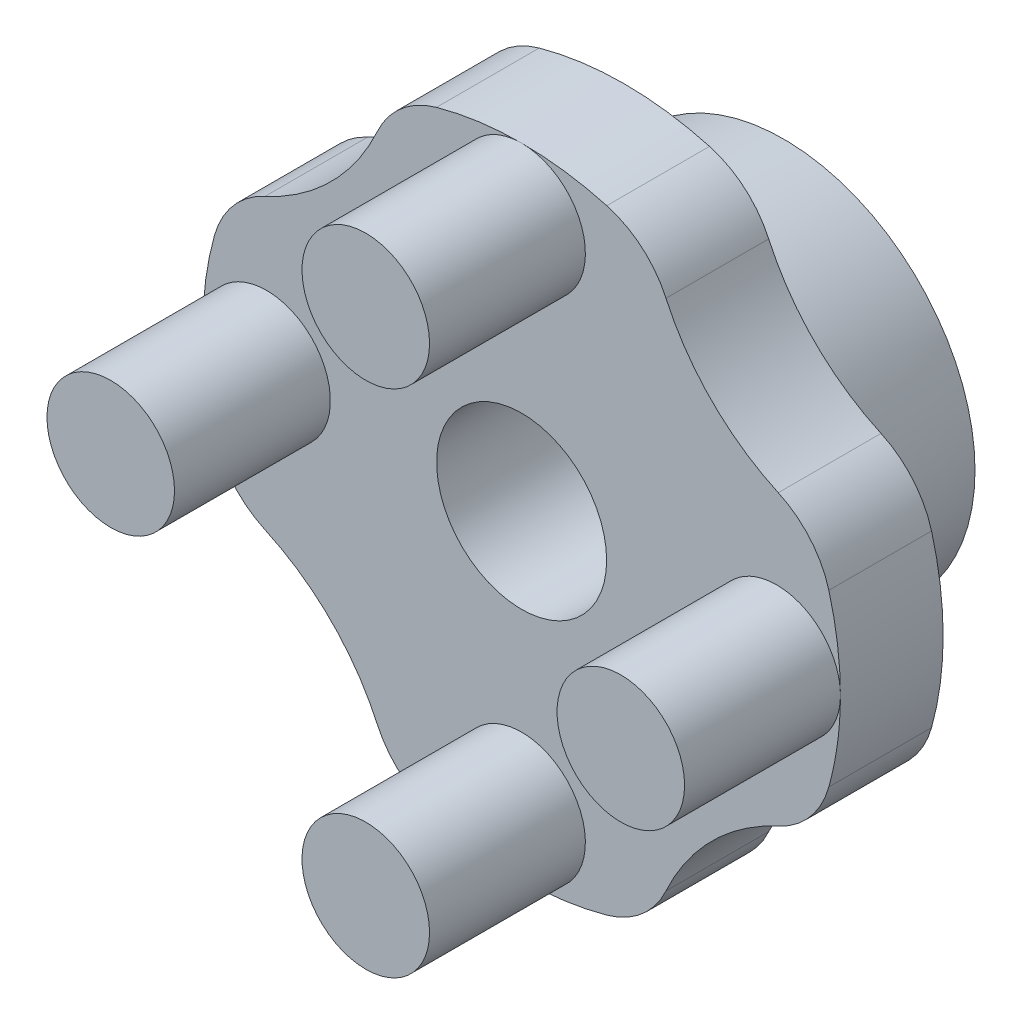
ISO-10303-21;
HEADER;
FILE_DESCRIPTION(('STEP AP214'),'2;1');
FILE_NAME('part.step','',(''),(''),'','','');
FILE_SCHEMA(('AUTOMOTIVE_DESIGN { 1 0 10303 214 1 1 1 1 }'));
ENDSEC;
DATA;
#1=APPLICATION_CONTEXT('core data for automotive mechanical design processes');
#2=APPLICATION_PROTOCOL_DEFINITION('international standard','automotive_design',2000,#1);
#3=PRODUCT_CONTEXT('',#1,'mechanical');
#4=PRODUCT('Part','Part','',(#3));
#5=PRODUCT_RELATED_PRODUCT_CATEGORY('part','',(#4));
#6=PRODUCT_DEFINITION_FORMATION('','',#4);
#7=PRODUCT_DEFINITION_CONTEXT('part definition',#1,'design');
#8=PRODUCT_DEFINITION('design','',#6,#7);
#9=PRODUCT_DEFINITION_SHAPE('','',#8);
#10=(LENGTH_UNIT() NAMED_UNIT(*) SI_UNIT(.MILLI.,.METRE.));
#11=(NAMED_UNIT(*) PLANE_ANGLE_UNIT() SI_UNIT($,.RADIAN.));
#12=(NAMED_UNIT(*) SI_UNIT($,.STERADIAN.) SOLID_ANGLE_UNIT());
#13=UNCERTAINTY_MEASURE_WITH_UNIT(LENGTH_MEASURE(1.E-05),#10,'distance_accuracy_value','');
#14=(GEOMETRIC_REPRESENTATION_CONTEXT(3) GLOBAL_UNCERTAINTY_ASSIGNED_CONTEXT((#13)) GLOBAL_UNIT_ASSIGNED_CONTEXT((#10,
#11,#12)) REPRESENTATION_CONTEXT('',''));
#15=CARTESIAN_POINT('',(0.,0.,0.));
#16=DIRECTION('',(0.,0.,1.));
#17=DIRECTION('',(1.,0.,0.));
#18=AXIS2_PLACEMENT_3D('',#15,#16,#17);
#19=CARTESIAN_POINT('',(0.,0.,90.));
#20=DIRECTION('',(0.,0.,1.));
#21=DIRECTION('',(1.,0.,0.));
#22=AXIS2_PLACEMENT_3D('',#19,#20,#21);
#23=CYLINDRICAL_SURFACE('',#22,45.);
#24=CARTESIAN_POINT('',(0.,0.,22.5));
#25=DIRECTION('',(0.,0.,1.));
#26=DIRECTION('',(1.,0.,0.));
#27=AXIS2_PLACEMENT_3D('',#24,#25,#26);
#28=CIRCLE('',#27,45.);
#29=CARTESIAN_POINT('',(-43.3644250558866,12.021923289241,22.5));
#30=VERTEX_POINT('',#29);
#31=CARTESIAN_POINT('',(-43.3644250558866,-12.0219232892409,22.5));
#32=VERTEX_POINT('',#31);
#33=EDGE_CURVE('E171',#30,#32,#28,.T.);
#34=ORIENTED_EDGE('',*,*,#33,.T.);
#35=DIRECTION('',(0.,0.,1.));
#36=VECTOR('',#35,1.);
#37=CARTESIAN_POINT('',(-43.3644250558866,-12.0219232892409,90.));
#38=LINE('',#37,#36);
#39=CARTESIAN_POINT('',(-43.3644250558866,-12.0219232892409,37.));
#40=VERTEX_POINT('',#39);
#41=EDGE_CURVE('E225',#32,#40,#38,.T.);
#42=ORIENTED_EDGE('',*,*,#41,.T.);
#43=CARTESIAN_POINT('',(0.,0.,37.));
#44=DIRECTION('',(0.,0.,1.));
#45=DIRECTION('',(1.,0.,0.));
#46=AXIS2_PLACEMENT_3D('',#43,#44,#45);
#47=CIRCLE('',#46,45.);
#48=CARTESIAN_POINT('',(-45.,0.,37.));
#49=VERTEX_POINT('',#48);
#50=EDGE_CURVE('E161',#49,#40,#47,.T.);
#51=ORIENTED_EDGE('',*,*,#50,.F.);
#52=CARTESIAN_POINT('',(-43.3644250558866,12.021923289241,37.));
#53=VERTEX_POINT('',#52);
#54=EDGE_CURVE('E157',#53,#49,#47,.T.);
#55=ORIENTED_EDGE('',*,*,#54,.F.);
#56=DIRECTION('',(0.,0.,1.));
#57=VECTOR('',#56,1.);
#58=CARTESIAN_POINT('',(-43.3644250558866,12.021923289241,90.));
#59=LINE('',#58,#57);
#60=EDGE_CURVE('E223',#53,#30,#59,.F.);
#61=ORIENTED_EDGE('',*,*,#60,.T.);
#62=EDGE_LOOP('',(#34,#42,#51,#55,#61));
#63=FACE_BOUND('',#62,.T.);
#64=ADVANCED_FACE('F14',(#63),#23,.T.);
#65=CARTESIAN_POINT('',(-45.,0.,37.));
#66=DIRECTION('',(0.,0.,-1.));
#67=DIRECTION('',(-1.,0.,0.));
#68=AXIS2_PLACEMENT_3D('',#65,#66,#67);
#69=PLANE('',#68);
#70=CARTESIAN_POINT('',(0.,0.,37.));
#71=DIRECTION('',(0.,0.,1.));
#72=DIRECTION('',(1.,0.,0.));
#73=AXIS2_PLACEMENT_3D('',#70,#71,#72);
#74=CIRCLE('',#73,12.);
#75=CARTESIAN_POINT('',(12.,0.,37.));
#76=VERTEX_POINT('',#75);
#77=EDGE_CURVE('E319',#76,#76,#74,.T.);
#78=ORIENTED_EDGE('',*,*,#77,.F.);
#79=EDGE_LOOP('',(#78));
#80=FACE_BOUND('',#79,.T.);
#81=CARTESIAN_POINT('',(0.,-45.,37.));
#82=VERTEX_POINT('',#81);
#83=CARTESIAN_POINT('',(12.021923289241,-43.3644250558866,37.));
#84=VERTEX_POINT('',#83);
#85=EDGE_CURVE('E147',#82,#84,#47,.T.);
#86=ORIENTED_EDGE('',*,*,#85,.T.);
#87=CARTESIAN_POINT('',(8.54892322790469,-30.836924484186,37.));
#88=DIRECTION('',(0.,0.,-1.));
#89=DIRECTION('',(-1.,0.,0.));
#90=AXIS2_PLACEMENT_3D('',#87,#88,#89);
#91=CIRCLE('',#90,13.);
#92=CARTESIAN_POINT('',(20.3785047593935,-36.2277500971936,37.));
#93=VERTEX_POINT('',#92);
#94=EDGE_CURVE('E246',#84,#93,#91,.F.);
#95=ORIENTED_EDGE('',*,*,#94,.T.);
#96=CARTESIAN_POINT('',(49.4974746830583,-49.4974746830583,37.));
#97=DIRECTION('',(0.,0.,1.));
#98=DIRECTION('',(1.,0.,0.));
#99=AXIS2_PLACEMENT_3D('',#96,#97,#98);
#100=CIRCLE('',#99,32.);
#101=CARTESIAN_POINT('',(36.2277500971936,-20.3785047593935,37.));
#102=VERTEX_POINT('',#101);
#103=EDGE_CURVE('E285',#102,#93,#100,.T.);
#104=ORIENTED_EDGE('',*,*,#103,.F.);
#105=CARTESIAN_POINT('',(30.836924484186,-8.54892322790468,37.));
#106=DIRECTION('',(0.,0.,-1.));
#107=DIRECTION('',(-1.,0.,0.));
#108=AXIS2_PLACEMENT_3D('',#105,#106,#107);
#109=CIRCLE('',#108,13.);
#110=CARTESIAN_POINT('',(43.3644250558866,-12.021923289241,37.));
#111=VERTEX_POINT('',#110);
#112=EDGE_CURVE('E146',#102,#111,#109,.F.);
#113=ORIENTED_EDGE('',*,*,#112,.T.);
#114=CARTESIAN_POINT('',(45.,0.,37.));
#115=VERTEX_POINT('',#114);
#116=EDGE_CURVE('E139',#111,#115,#47,.T.);
#117=ORIENTED_EDGE('',*,*,#116,.T.);
#118=CARTESIAN_POINT('',(36.,0.,37.));
#119=DIRECTION('',(0.,0.,1.));
#120=DIRECTION('',(1.,0.,0.));
#121=AXIS2_PLACEMENT_3D('',#118,#119,#120);
#122=CIRCLE('',#121,9.);
#123=EDGE_CURVE('E144',#115,#115,#122,.T.);
#124=ORIENTED_EDGE('',*,*,#123,.F.);
#125=CARTESIAN_POINT('',(43.3644250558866,12.021923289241,37.));
#126=VERTEX_POINT('',#125);
#127=EDGE_CURVE('E148',#115,#126,#47,.T.);
#128=ORIENTED_EDGE('',*,*,#127,.T.);
#129=CARTESIAN_POINT('',(30.836924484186,8.5489232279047,37.));
#130=DIRECTION('',(0.,0.,-1.));
#131=DIRECTION('',(-1.,0.,0.));
#132=AXIS2_PLACEMENT_3D('',#129,#130,#131);
#133=CIRCLE('',#132,13.);
#134=CARTESIAN_POINT('',(36.2277500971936,20.3785047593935,37.));
#135=VERTEX_POINT('',#134);
#136=EDGE_CURVE('E207',#126,#135,#133,.F.);
#137=ORIENTED_EDGE('',*,*,#136,.T.);
#138=CARTESIAN_POINT('',(49.4974746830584,49.4974746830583,37.));
#139=DIRECTION('',(0.,0.,-1.));
#140=DIRECTION('',(-1.,0.,0.));
#141=AXIS2_PLACEMENT_3D('',#138,#139,#140);
#142=CIRCLE('',#141,32.);
#143=CARTESIAN_POINT('',(20.3785047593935,36.2277500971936,37.));
#144=VERTEX_POINT('',#143);
#145=EDGE_CURVE('E290',#135,#144,#142,.T.);
#146=ORIENTED_EDGE('',*,*,#145,.T.);
#147=CARTESIAN_POINT('',(8.5489232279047,30.836924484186,37.));
#148=DIRECTION('',(0.,0.,-1.));
#149=DIRECTION('',(-1.,0.,0.));
#150=AXIS2_PLACEMENT_3D('',#147,#148,#149);
#151=CIRCLE('',#150,13.);
#152=CARTESIAN_POINT('',(12.021923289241,43.3644250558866,37.));
#153=VERTEX_POINT('',#152);
#154=EDGE_CURVE('E203',#144,#153,#151,.F.);
#155=ORIENTED_EDGE('',*,*,#154,.T.);
#156=CARTESIAN_POINT('',(0.,45.,37.));
#157=VERTEX_POINT('',#156);
#158=EDGE_CURVE('E155',#153,#157,#47,.T.);
#159=ORIENTED_EDGE('',*,*,#158,.T.);
#160=CARTESIAN_POINT('',(0.,36.,37.));
#161=DIRECTION('',(0.,0.,1.));
#162=DIRECTION('',(1.,0.,0.));
#163=AXIS2_PLACEMENT_3D('',#160,#161,#162);
#164=CIRCLE('',#163,9.);
#165=EDGE_CURVE('E277',#157,#157,#164,.T.);
#166=ORIENTED_EDGE('',*,*,#165,.F.);
#167=CARTESIAN_POINT('',(-12.021923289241,43.3644250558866,37.));
#168=VERTEX_POINT('',#167);
#169=EDGE_CURVE('E156',#157,#168,#47,.T.);
#170=ORIENTED_EDGE('',*,*,#169,.T.);
#171=CARTESIAN_POINT('',(-8.54892322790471,30.836924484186,37.));
#172=DIRECTION('',(0.,0.,-1.));
#173=DIRECTION('',(-1.,0.,0.));
#174=AXIS2_PLACEMENT_3D('',#171,#172,#173);
#175=CIRCLE('',#174,13.);
#176=CARTESIAN_POINT('',(-20.3785047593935,36.2277500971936,37.));
#177=VERTEX_POINT('',#176);
#178=EDGE_CURVE('E202',#168,#177,#175,.F.);
#179=ORIENTED_EDGE('',*,*,#178,.T.);
#180=CARTESIAN_POINT('',(-49.4974746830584,49.4974746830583,37.));
#181=DIRECTION('',(0.,0.,1.));
#182=DIRECTION('',(1.,0.,0.));
#183=AXIS2_PLACEMENT_3D('',#180,#181,#182);
#184=CIRCLE('',#183,32.);
#185=CARTESIAN_POINT('',(-36.2277500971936,20.3785047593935,37.));
#186=VERTEX_POINT('',#185);
#187=EDGE_CURVE('E302',#186,#177,#184,.T.);
#188=ORIENTED_EDGE('',*,*,#187,.F.);
#189=CARTESIAN_POINT('',(-30.836924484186,8.5489232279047,37.));
#190=DIRECTION('',(0.,0.,-1.));
#191=DIRECTION('',(-1.,0.,0.));
#192=AXIS2_PLACEMENT_3D('',#189,#190,#191);
#193=CIRCLE('',#192,13.);
#194=EDGE_CURVE('E309',#186,#53,#193,.F.);
#195=ORIENTED_EDGE('',*,*,#194,.T.);
#196=ORIENTED_EDGE('',*,*,#54,.T.);
#197=CARTESIAN_POINT('',(-36.,0.,37.));
#198=DIRECTION('',(0.,0.,1.));
#199=DIRECTION('',(1.,0.,0.));
#200=AXIS2_PLACEMENT_3D('',#197,#198,#199);
#201=CIRCLE('',#200,9.);
#202=EDGE_CURVE('E269',#49,#49,#201,.T.);
#203=ORIENTED_EDGE('',*,*,#202,.F.);
#204=ORIENTED_EDGE('',*,*,#50,.T.);
#205=CARTESIAN_POINT('',(-30.836924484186,-8.54892322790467,37.));
#206=DIRECTION('',(0.,0.,-1.));
#207=DIRECTION('',(-1.,0.,0.));
#208=AXIS2_PLACEMENT_3D('',#205,#206,#207);
#209=CIRCLE('',#208,13.);
#210=CARTESIAN_POINT('',(-36.2277500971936,-20.3785047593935,37.));
#211=VERTEX_POINT('',#210);
#212=EDGE_CURVE('E230',#40,#211,#209,.F.);
#213=ORIENTED_EDGE('',*,*,#212,.T.);
#214=CARTESIAN_POINT('',(-49.4974746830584,-49.4974746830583,37.));
#215=DIRECTION('',(0.,0.,-1.));
#216=DIRECTION('',(-1.,0.,0.));
#217=AXIS2_PLACEMENT_3D('',#214,#215,#216);
#218=CIRCLE('',#217,32.);
#219=CARTESIAN_POINT('',(-20.3785047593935,-36.2277500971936,37.));
#220=VERTEX_POINT('',#219);
#221=EDGE_CURVE('E296',#211,#220,#218,.T.);
#222=ORIENTED_EDGE('',*,*,#221,.T.);
#223=CARTESIAN_POINT('',(-8.54892322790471,-30.836924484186,37.));
#224=DIRECTION('',(0.,0.,-1.));
#225=DIRECTION('',(-1.,0.,0.));
#226=AXIS2_PLACEMENT_3D('',#223,#224,#225);
#227=CIRCLE('',#226,13.);
#228=CARTESIAN_POINT('',(-12.021923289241,-43.3644250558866,37.));
#229=VERTEX_POINT('',#228);
#230=EDGE_CURVE('E228',#220,#229,#227,.F.);
#231=ORIENTED_EDGE('',*,*,#230,.T.);
#232=EDGE_CURVE('E150',#229,#82,#47,.T.);
#233=ORIENTED_EDGE('',*,*,#232,.T.);
#234=CARTESIAN_POINT('',(0.,-36.,37.));
#235=DIRECTION('',(0.,0.,1.));
#236=DIRECTION('',(1.,0.,0.));
#237=AXIS2_PLACEMENT_3D('',#234,#235,#236);
#238=CIRCLE('',#237,9.);
#239=EDGE_CURVE('E263',#82,#82,#238,.T.);
#240=ORIENTED_EDGE('',*,*,#239,.F.);
#241=EDGE_LOOP('',(#86,#95,#104,#113,#117,#124,#128,#137,#146,#155,#159,#166,#170,#179,#188,
#195,#196,#203,#204,#213,#222,#231,#233,#240));
#242=FACE_BOUND('',#241,.T.);
#243=ADVANCED_FACE('F16',(#80,#242),#69,.F.);
#244=CARTESIAN_POINT('',(-28.5,0.,22.5));
#245=DIRECTION('',(0.,0.,1.));
#246=DIRECTION('',(1.,0.,0.));
#247=AXIS2_PLACEMENT_3D('',#244,#245,#246);
#248=PLANE('',#247);
#249=CARTESIAN_POINT('',(0.,0.,22.5));
#250=DIRECTION('',(0.,0.,1.));
#251=DIRECTION('',(1.,0.,0.));
#252=AXIS2_PLACEMENT_3D('',#249,#250,#251);
#253=CIRCLE('',#252,28.5);
#254=CARTESIAN_POINT('',(28.5,0.,22.5));
#255=VERTEX_POINT('',#254);
#256=EDGE_CURVE('E180',#255,#255,#253,.T.);
#257=ORIENTED_EDGE('',*,*,#256,.T.);
#258=EDGE_LOOP('',(#257));
#259=FACE_BOUND('',#258,.T.);
#260=CARTESIAN_POINT('',(49.4974746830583,-49.4974746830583,22.5));
#261=DIRECTION('',(0.,0.,1.));
#262=DIRECTION('',(1.,0.,0.));
#263=AXIS2_PLACEMENT_3D('',#260,#261,#262);
#264=CIRCLE('',#263,32.);
#265=CARTESIAN_POINT('',(36.2277500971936,-20.3785047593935,22.5));
#266=VERTEX_POINT('',#265);
#267=CARTESIAN_POINT('',(20.3785047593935,-36.2277500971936,22.5));
#268=VERTEX_POINT('',#267);
#269=EDGE_CURVE('E256',#266,#268,#264,.T.);
#270=ORIENTED_EDGE('',*,*,#269,.T.);
#271=CARTESIAN_POINT('',(8.54892322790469,-30.836924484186,22.5));
#272=DIRECTION('',(0.,0.,1.));
#273=DIRECTION('',(1.,0.,0.));
#274=AXIS2_PLACEMENT_3D('',#271,#272,#273);
#275=CIRCLE('',#274,13.);
#276=CARTESIAN_POINT('',(12.021923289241,-43.3644250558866,22.5));
#277=VERTEX_POINT('',#276);
#278=EDGE_CURVE('E22',#268,#277,#275,.F.);
#279=ORIENTED_EDGE('',*,*,#278,.T.);
#280=CARTESIAN_POINT('',(-12.021923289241,-43.3644250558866,22.5));
#281=VERTEX_POINT('',#280);
#282=EDGE_CURVE('E167',#281,#277,#28,.T.);
#283=ORIENTED_EDGE('',*,*,#282,.F.);
#284=CARTESIAN_POINT('',(-8.54892322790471,-30.836924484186,22.5));
#285=DIRECTION('',(0.,0.,1.));
#286=DIRECTION('',(1.,0.,0.));
#287=AXIS2_PLACEMENT_3D('',#284,#285,#286);
#288=CIRCLE('',#287,13.);
#289=CARTESIAN_POINT('',(-20.3785047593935,-36.2277500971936,22.5));
#290=VERTEX_POINT('',#289);
#291=EDGE_CURVE('E237',#281,#290,#288,.F.);
#292=ORIENTED_EDGE('',*,*,#291,.T.);
#293=CARTESIAN_POINT('',(-49.4974746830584,-49.4974746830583,22.5));
#294=DIRECTION('',(0.,0.,1.));
#295=DIRECTION('',(1.,0.,0.));
#296=AXIS2_PLACEMENT_3D('',#293,#294,#295);
#297=CIRCLE('',#296,32.);
#298=CARTESIAN_POINT('',(-36.2277500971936,-20.3785047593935,22.5));
#299=VERTEX_POINT('',#298);
#300=EDGE_CURVE('E293',#299,#290,#297,.F.);
#301=ORIENTED_EDGE('',*,*,#300,.F.);
#302=CARTESIAN_POINT('',(-30.836924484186,-8.54892322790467,22.5));
#303=DIRECTION('',(0.,0.,1.));
#304=DIRECTION('',(1.,0.,0.));
#305=AXIS2_PLACEMENT_3D('',#302,#303,#304);
#306=CIRCLE('',#305,13.);
#307=EDGE_CURVE('E239',#299,#32,#306,.F.);
#308=ORIENTED_EDGE('',*,*,#307,.T.);
#309=ORIENTED_EDGE('',*,*,#33,.F.);
#310=CARTESIAN_POINT('',(-30.836924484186,8.5489232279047,22.5));
#311=DIRECTION('',(0.,0.,1.));
#312=DIRECTION('',(1.,0.,0.));
#313=AXIS2_PLACEMENT_3D('',#310,#311,#312);
#314=CIRCLE('',#313,13.);
#315=CARTESIAN_POINT('',(-36.2277500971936,20.3785047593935,22.5));
#316=VERTEX_POINT('',#315);
#317=EDGE_CURVE('E205',#30,#316,#314,.F.);
#318=ORIENTED_EDGE('',*,*,#317,.T.);
#319=CARTESIAN_POINT('',(-49.4974746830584,49.4974746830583,22.5));
#320=DIRECTION('',(0.,0.,1.));
#321=DIRECTION('',(1.,0.,0.));
#322=AXIS2_PLACEMENT_3D('',#319,#320,#321);
#323=CIRCLE('',#322,32.);
#324=CARTESIAN_POINT('',(-20.3785047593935,36.2277500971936,22.5));
#325=VERTEX_POINT('',#324);
#326=EDGE_CURVE('E299',#316,#325,#323,.T.);
#327=ORIENTED_EDGE('',*,*,#326,.T.);
#328=CARTESIAN_POINT('',(-8.54892322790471,30.836924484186,22.5));
#329=DIRECTION('',(0.,0.,1.));
#330=DIRECTION('',(1.,0.,0.));
#331=AXIS2_PLACEMENT_3D('',#328,#329,#330);
#332=CIRCLE('',#331,13.);
#333=CARTESIAN_POINT('',(-12.021923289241,43.3644250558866,22.5));
#334=VERTEX_POINT('',#333);
#335=EDGE_CURVE('E201',#325,#334,#332,.F.);
#336=ORIENTED_EDGE('',*,*,#335,.T.);
#337=CARTESIAN_POINT('',(12.021923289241,43.3644250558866,22.5));
#338=VERTEX_POINT('',#337);
#339=EDGE_CURVE('E178',#338,#334,#28,.T.);
#340=ORIENTED_EDGE('',*,*,#339,.F.);
#341=CARTESIAN_POINT('',(8.5489232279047,30.836924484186,22.5));
#342=DIRECTION('',(0.,0.,1.));
#343=DIRECTION('',(1.,0.,0.));
#344=AXIS2_PLACEMENT_3D('',#341,#342,#343);
#345=CIRCLE('',#344,13.);
#346=CARTESIAN_POINT('',(20.3785047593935,36.2277500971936,22.5));
#347=VERTEX_POINT('',#346);
#348=EDGE_CURVE('E215',#338,#347,#345,.F.);
#349=ORIENTED_EDGE('',*,*,#348,.T.);
#350=CARTESIAN_POINT('',(49.4974746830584,49.4974746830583,22.5));
#351=DIRECTION('',(0.,0.,1.));
#352=DIRECTION('',(1.,0.,0.));
#353=AXIS2_PLACEMENT_3D('',#350,#351,#352);
#354=CIRCLE('',#353,32.);
#355=CARTESIAN_POINT('',(36.2277500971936,20.3785047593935,22.5));
#356=VERTEX_POINT('',#355);
#357=EDGE_CURVE('E287',#356,#347,#354,.F.);
#358=ORIENTED_EDGE('',*,*,#357,.F.);
#359=CARTESIAN_POINT('',(30.836924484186,8.5489232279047,22.5));
#360=DIRECTION('',(0.,0.,1.));
#361=DIRECTION('',(1.,0.,0.));
#362=AXIS2_PLACEMENT_3D('',#359,#360,#361);
#363=CIRCLE('',#362,13.);
#364=CARTESIAN_POINT('',(43.3644250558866,12.021923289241,22.5));
#365=VERTEX_POINT('',#364);
#366=EDGE_CURVE('E213',#356,#365,#363,.F.);
#367=ORIENTED_EDGE('',*,*,#366,.T.);
#368=CARTESIAN_POINT('',(43.3644250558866,-12.021923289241,22.5));
#369=VERTEX_POINT('',#368);
#370=EDGE_CURVE('E172',#369,#365,#28,.T.);
#371=ORIENTED_EDGE('',*,*,#370,.F.);
#372=CARTESIAN_POINT('',(30.836924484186,-8.54892322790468,22.5));
#373=DIRECTION('',(0.,0.,1.));
#374=DIRECTION('',(1.,0.,0.));
#375=AXIS2_PLACEMENT_3D('',#372,#373,#374);
#376=CIRCLE('',#375,13.);
#377=EDGE_CURVE('E252',#369,#266,#376,.F.);
#378=ORIENTED_EDGE('',*,*,#377,.T.);
#379=EDGE_LOOP('',(#270,#279,#283,#292,#301,#308,#309,#318,#327,#336,#340,#349,#358,#367,#371,#378));
#380=FACE_BOUND('',#379,.T.);
#381=ADVANCED_FACE('F254',(#259,#380),#248,.F.);
#382=ORIENTED_EDGE('',*,*,#282,.T.);
#383=DIRECTION('',(0.,0.,1.));
#384=VECTOR('',#383,1.);
#385=CARTESIAN_POINT('',(12.021923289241,-43.3644250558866,90.));
#386=LINE('',#385,#384);
#387=EDGE_CURVE('E243',#277,#84,#386,.T.);
#388=ORIENTED_EDGE('',*,*,#387,.T.);
#389=ORIENTED_EDGE('',*,*,#85,.F.);
#390=ORIENTED_EDGE('',*,*,#232,.F.);
#391=DIRECTION('',(0.,0.,1.));
#392=VECTOR('',#391,1.);
#393=CARTESIAN_POINT('',(-12.021923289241,-43.3644250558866,90.));
#394=LINE('',#393,#392);
#395=EDGE_CURVE('E241',#229,#281,#394,.F.);
#396=ORIENTED_EDGE('',*,*,#395,.T.);
#397=EDGE_LOOP('',(#382,#388,#389,#390,#396));
#398=FACE_BOUND('',#397,.T.);
#399=ADVANCED_FACE('F259',(#398),#23,.T.);
#400=ORIENTED_EDGE('',*,*,#158,.F.);
#401=DIRECTION('',(0.,0.,1.));
#402=VECTOR('',#401,1.);
#403=CARTESIAN_POINT('',(12.021923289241,43.3644250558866,90.));
#404=LINE('',#403,#402);
#405=EDGE_CURVE('E194',#153,#338,#404,.F.);
#406=ORIENTED_EDGE('',*,*,#405,.T.);
#407=ORIENTED_EDGE('',*,*,#339,.T.);
#408=DIRECTION('',(0.,0.,1.));
#409=VECTOR('',#408,1.);
#410=CARTESIAN_POINT('',(-12.021923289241,43.3644250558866,90.));
#411=LINE('',#410,#409);
#412=EDGE_CURVE('E192',#334,#168,#411,.T.);
#413=ORIENTED_EDGE('',*,*,#412,.T.);
#414=ORIENTED_EDGE('',*,*,#169,.F.);
#415=EDGE_LOOP('',(#400,#406,#407,#413,#414));
#416=FACE_BOUND('',#415,.T.);
#417=ADVANCED_FACE('F190',(#416),#23,.T.);
#418=ORIENTED_EDGE('',*,*,#116,.F.);
#419=DIRECTION('',(0.,0.,1.));
#420=VECTOR('',#419,1.);
#421=CARTESIAN_POINT('',(43.3644250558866,-12.021923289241,90.));
#422=LINE('',#421,#420);
#423=EDGE_CURVE('E9',#111,#369,#422,.F.);
#424=ORIENTED_EDGE('',*,*,#423,.T.);
#425=ORIENTED_EDGE('',*,*,#370,.T.);
#426=DIRECTION('',(0.,0.,1.));
#427=VECTOR('',#426,1.);
#428=CARTESIAN_POINT('',(43.3644250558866,12.021923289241,90.));
#429=LINE('',#428,#427);
#430=EDGE_CURVE('E154',#365,#126,#429,.T.);
#431=ORIENTED_EDGE('',*,*,#430,.T.);
#432=ORIENTED_EDGE('',*,*,#127,.F.);
#433=EDGE_LOOP('',(#418,#424,#425,#431,#432));
#434=FACE_BOUND('',#433,.T.);
#435=ADVANCED_FACE('F152',(#434),#23,.T.);
#436=CARTESIAN_POINT('',(0.,0.,90.));
#437=DIRECTION('',(0.,0.,1.));
#438=DIRECTION('',(1.,0.,0.));
#439=AXIS2_PLACEMENT_3D('',#436,#437,#438);
#440=CYLINDRICAL_SURFACE('',#439,12.);
#441=CARTESIAN_POINT('',(0.,0.,0.));
#442=DIRECTION('',(0.,0.,1.));
#443=DIRECTION('',(1.,0.,0.));
#444=AXIS2_PLACEMENT_3D('',#441,#442,#443);
#445=CIRCLE('',#444,12.);
#446=CARTESIAN_POINT('',(12.,0.,0.));
#447=VERTEX_POINT('',#446);
#448=EDGE_CURVE('E322',#447,#447,#445,.T.);
#449=ORIENTED_EDGE('',*,*,#448,.F.);
#450=EDGE_LOOP('',(#449));
#451=FACE_BOUND('',#450,.T.);
#452=ORIENTED_EDGE('',*,*,#77,.T.);
#453=EDGE_LOOP('',(#452));
#454=FACE_BOUND('',#453,.T.);
#455=ADVANCED_FACE('F334',(#451,#454),#440,.F.);
#456=CARTESIAN_POINT('',(-12.,0.,0.));
#457=DIRECTION('',(0.,0.,1.));
#458=DIRECTION('',(1.,0.,0.));
#459=AXIS2_PLACEMENT_3D('',#456,#457,#458);
#460=PLANE('',#459);
#461=CARTESIAN_POINT('',(0.,0.,0.));
#462=DIRECTION('',(0.,0.,1.));
#463=DIRECTION('',(1.,0.,0.));
#464=AXIS2_PLACEMENT_3D('',#461,#462,#463);
#465=CIRCLE('',#464,27.);
#466=CARTESIAN_POINT('',(27.,0.,0.));
#467=VERTEX_POINT('',#466);
#468=EDGE_CURVE('E183',#467,#467,#465,.T.);
#469=ORIENTED_EDGE('',*,*,#468,.F.);
#470=EDGE_LOOP('',(#469));
#471=FACE_BOUND('',#470,.T.);
#472=ORIENTED_EDGE('',*,*,#448,.T.);
#473=EDGE_LOOP('',(#472));
#474=FACE_BOUND('',#473,.T.);
#475=ADVANCED_FACE('F331',(#471,#474),#460,.F.);
#476=CARTESIAN_POINT('',(0.,0.,22.5));
#477=DIRECTION('',(0.,0.,1.));
#478=DIRECTION('',(1.,0.,0.));
#479=AXIS2_PLACEMENT_3D('',#476,#477,#478);
#480=CONICAL_SURFACE('',#479,28.5,0.0665681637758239);
#481=ORIENTED_EDGE('',*,*,#468,.T.);
#482=EDGE_LOOP('',(#481));
#483=FACE_BOUND('',#482,.T.);
#484=ORIENTED_EDGE('',*,*,#256,.F.);
#485=EDGE_LOOP('',(#484));
#486=FACE_BOUND('',#485,.T.);
#487=ADVANCED_FACE('F328',(#483,#486),#480,.T.);
#488=CARTESIAN_POINT('',(0.,-36.,59.));
#489=DIRECTION('',(0.,0.,-1.));
#490=DIRECTION('',(-1.,0.,0.));
#491=AXIS2_PLACEMENT_3D('',#488,#489,#490);
#492=CYLINDRICAL_SURFACE('',#491,9.);
#493=CARTESIAN_POINT('',(0.,-36.,59.));
#494=DIRECTION('',(0.,0.,1.));
#495=DIRECTION('',(1.,0.,0.));
#496=AXIS2_PLACEMENT_3D('',#493,#494,#495);
#497=CIRCLE('',#496,9.);
#498=CARTESIAN_POINT('',(9.,-36.,59.));
#499=VERTEX_POINT('',#498);
#500=EDGE_CURVE('E166',#499,#499,#497,.T.);
#501=ORIENTED_EDGE('',*,*,#500,.F.);
#502=EDGE_LOOP('',(#501));
#503=FACE_BOUND('',#502,.T.);
#504=ORIENTED_EDGE('',*,*,#239,.T.);
#505=EDGE_LOOP('',(#504));
#506=FACE_BOUND('',#505,.T.);
#507=ADVANCED_FACE('F383',(#503,#506),#492,.T.);
#508=CARTESIAN_POINT('',(0.,-36.,59.));
#509=DIRECTION('',(0.,0.,1.));
#510=DIRECTION('',(1.,0.,0.));
#511=AXIS2_PLACEMENT_3D('',#508,#509,#510);
#512=PLANE('',#511);
#513=ORIENTED_EDGE('',*,*,#500,.T.);
#514=EDGE_LOOP('',(#513));
#515=FACE_BOUND('',#514,.T.);
#516=ADVANCED_FACE('F385',(#515),#512,.T.);
#517=CARTESIAN_POINT('',(-36.,0.,59.));
#518=DIRECTION('',(0.,0.,-1.));
#519=DIRECTION('',(-1.,0.,0.));
#520=AXIS2_PLACEMENT_3D('',#517,#518,#519);
#521=CYLINDRICAL_SURFACE('',#520,9.);
#522=CARTESIAN_POINT('',(-36.,0.,59.));
#523=DIRECTION('',(0.,0.,1.));
#524=DIRECTION('',(1.,0.,0.));
#525=AXIS2_PLACEMENT_3D('',#522,#523,#524);
#526=CIRCLE('',#525,9.);
#527=CARTESIAN_POINT('',(-27.,0.,59.));
#528=VERTEX_POINT('',#527);
#529=EDGE_CURVE('E265',#528,#528,#526,.T.);
#530=ORIENTED_EDGE('',*,*,#529,.F.);
#531=EDGE_LOOP('',(#530));
#532=FACE_BOUND('',#531,.T.);
#533=ORIENTED_EDGE('',*,*,#202,.T.);
#534=EDGE_LOOP('',(#533));
#535=FACE_BOUND('',#534,.T.);
#536=ADVANCED_FACE('F400',(#532,#535),#521,.T.);
#537=CARTESIAN_POINT('',(-36.,0.,59.));
#538=DIRECTION('',(0.,0.,1.));
#539=DIRECTION('',(1.,0.,0.));
#540=AXIS2_PLACEMENT_3D('',#537,#538,#539);
#541=PLANE('',#540);
#542=ORIENTED_EDGE('',*,*,#529,.T.);
#543=EDGE_LOOP('',(#542));
#544=FACE_BOUND('',#543,.T.);
#545=ADVANCED_FACE('F393',(#544),#541,.T.);
#546=CARTESIAN_POINT('',(0.,36.,59.));
#547=DIRECTION('',(0.,0.,-1.));
#548=DIRECTION('',(-1.,0.,0.));
#549=AXIS2_PLACEMENT_3D('',#546,#547,#548);
#550=CYLINDRICAL_SURFACE('',#549,9.);
#551=CARTESIAN_POINT('',(0.,36.,59.));
#552=DIRECTION('',(0.,0.,1.));
#553=DIRECTION('',(1.,0.,0.));
#554=AXIS2_PLACEMENT_3D('',#551,#552,#553);
#555=CIRCLE('',#554,9.);
#556=CARTESIAN_POINT('',(9.,36.,59.));
#557=VERTEX_POINT('',#556);
#558=EDGE_CURVE('E274',#557,#557,#555,.T.);
#559=ORIENTED_EDGE('',*,*,#558,.F.);
#560=EDGE_LOOP('',(#559));
#561=FACE_BOUND('',#560,.T.);
#562=ORIENTED_EDGE('',*,*,#165,.T.);
#563=EDGE_LOOP('',(#562));
#564=FACE_BOUND('',#563,.T.);
#565=ADVANCED_FACE('F418',(#561,#564),#550,.T.);
#566=CARTESIAN_POINT('',(0.,36.,59.));
#567=DIRECTION('',(0.,0.,1.));
#568=DIRECTION('',(1.,0.,0.));
#569=AXIS2_PLACEMENT_3D('',#566,#567,#568);
#570=PLANE('',#569);
#571=ORIENTED_EDGE('',*,*,#558,.T.);
#572=EDGE_LOOP('',(#571));
#573=FACE_BOUND('',#572,.T.);
#574=ADVANCED_FACE('F411',(#573),#570,.T.);
#575=CARTESIAN_POINT('',(36.,0.,59.));
#576=DIRECTION('',(0.,0.,-1.));
#577=DIRECTION('',(-1.,0.,0.));
#578=AXIS2_PLACEMENT_3D('',#575,#576,#577);
#579=CYLINDRICAL_SURFACE('',#578,9.);
#580=CARTESIAN_POINT('',(36.,0.,59.));
#581=DIRECTION('',(0.,0.,1.));
#582=DIRECTION('',(1.,0.,0.));
#583=AXIS2_PLACEMENT_3D('',#580,#581,#582);
#584=CIRCLE('',#583,9.);
#585=CARTESIAN_POINT('',(45.,0.,59.));
#586=VERTEX_POINT('',#585);
#587=EDGE_CURVE('E280',#586,#586,#584,.T.);
#588=ORIENTED_EDGE('',*,*,#587,.F.);
#589=EDGE_LOOP('',(#588));
#590=FACE_BOUND('',#589,.T.);
#591=ORIENTED_EDGE('',*,*,#123,.T.);
#592=EDGE_LOOP('',(#591));
#593=FACE_BOUND('',#592,.T.);
#594=ADVANCED_FACE('F436',(#590,#593),#579,.T.);
#595=CARTESIAN_POINT('',(36.,0.,59.));
#596=DIRECTION('',(0.,0.,1.));
#597=DIRECTION('',(1.,0.,0.));
#598=AXIS2_PLACEMENT_3D('',#595,#596,#597);
#599=PLANE('',#598);
#600=ORIENTED_EDGE('',*,*,#587,.T.);
#601=EDGE_LOOP('',(#600));
#602=FACE_BOUND('',#601,.T.);
#603=ADVANCED_FACE('F429',(#602),#599,.T.);
#604=CARTESIAN_POINT('',(49.4974746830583,-49.4974746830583,0.));
#605=DIRECTION('',(0.,0.,1.));
#606=DIRECTION('',(1.,0.,0.));
#607=AXIS2_PLACEMENT_3D('',#604,#605,#606);
#608=CYLINDRICAL_SURFACE('',#607,32.);
#609=ORIENTED_EDGE('',*,*,#103,.T.);
#610=DIRECTION('',(0.,0.,1.));
#611=VECTOR('',#610,1.);
#612=CARTESIAN_POINT('',(20.3785047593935,-36.2277500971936,0.));
#613=LINE('',#612,#611);
#614=EDGE_CURVE('E35',#93,#268,#613,.F.);
#615=ORIENTED_EDGE('',*,*,#614,.T.);
#616=ORIENTED_EDGE('',*,*,#269,.F.);
#617=DIRECTION('',(0.,0.,1.));
#618=VECTOR('',#617,1.);
#619=CARTESIAN_POINT('',(36.2277500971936,-20.3785047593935,0.));
#620=LINE('',#619,#618);
#621=EDGE_CURVE('E248',#266,#102,#620,.T.);
#622=ORIENTED_EDGE('',*,*,#621,.T.);
#623=EDGE_LOOP('',(#609,#615,#616,#622));
#624=FACE_BOUND('',#623,.T.);
#625=ADVANCED_FACE('F447',(#624),#608,.F.);
#626=CARTESIAN_POINT('',(49.4974746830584,49.4974746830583,0.));
#627=DIRECTION('',(0.,0.,1.));
#628=DIRECTION('',(1.,0.,0.));
#629=AXIS2_PLACEMENT_3D('',#626,#627,#628);
#630=CYLINDRICAL_SURFACE('',#629,32.);
#631=ORIENTED_EDGE('',*,*,#357,.T.);
#632=DIRECTION('',(0.,0.,1.));
#633=VECTOR('',#632,1.);
#634=CARTESIAN_POINT('',(20.3785047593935,36.2277500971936,0.));
#635=LINE('',#634,#633);
#636=EDGE_CURVE('E312',#347,#144,#635,.T.);
#637=ORIENTED_EDGE('',*,*,#636,.T.);
#638=ORIENTED_EDGE('',*,*,#145,.F.);
#639=DIRECTION('',(0.,0.,1.));
#640=VECTOR('',#639,1.);
#641=CARTESIAN_POINT('',(36.2277500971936,20.3785047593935,0.));
#642=LINE('',#641,#640);
#643=EDGE_CURVE('E317',#135,#356,#642,.F.);
#644=ORIENTED_EDGE('',*,*,#643,.T.);
#645=EDGE_LOOP('',(#631,#637,#638,#644));
#646=FACE_BOUND('',#645,.T.);
#647=ADVANCED_FACE('F462',(#646),#630,.F.);
#648=CARTESIAN_POINT('',(-49.4974746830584,-49.4974746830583,0.));
#649=DIRECTION('',(0.,0.,1.));
#650=DIRECTION('',(1.,0.,0.));
#651=AXIS2_PLACEMENT_3D('',#648,#649,#650);
#652=CYLINDRICAL_SURFACE('',#651,32.);
#653=ORIENTED_EDGE('',*,*,#221,.F.);
#654=DIRECTION('',(0.,0.,1.));
#655=VECTOR('',#654,1.);
#656=CARTESIAN_POINT('',(-36.2277500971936,-20.3785047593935,0.));
#657=LINE('',#656,#655);
#658=EDGE_CURVE('E235',#211,#299,#657,.F.);
#659=ORIENTED_EDGE('',*,*,#658,.T.);
#660=ORIENTED_EDGE('',*,*,#300,.T.);
#661=DIRECTION('',(0.,0.,1.));
#662=VECTOR('',#661,1.);
#663=CARTESIAN_POINT('',(-20.3785047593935,-36.2277500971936,0.));
#664=LINE('',#663,#662);
#665=EDGE_CURVE('E232',#290,#220,#664,.T.);
#666=ORIENTED_EDGE('',*,*,#665,.T.);
#667=EDGE_LOOP('',(#653,#659,#660,#666));
#668=FACE_BOUND('',#667,.T.);
#669=ADVANCED_FACE('F470',(#668),#652,.F.);
#670=CARTESIAN_POINT('',(-49.4974746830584,49.4974746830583,0.));
#671=DIRECTION('',(0.,0.,1.));
#672=DIRECTION('',(1.,0.,0.));
#673=AXIS2_PLACEMENT_3D('',#670,#671,#672);
#674=CYLINDRICAL_SURFACE('',#673,32.);
#675=ORIENTED_EDGE('',*,*,#187,.T.);
#676=DIRECTION('',(0.,0.,1.));
#677=VECTOR('',#676,1.);
#678=CARTESIAN_POINT('',(-20.3785047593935,36.2277500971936,0.));
#679=LINE('',#678,#677);
#680=EDGE_CURVE('E221',#177,#325,#679,.F.);
#681=ORIENTED_EDGE('',*,*,#680,.T.);
#682=ORIENTED_EDGE('',*,*,#326,.F.);
#683=DIRECTION('',(0.,0.,1.));
#684=VECTOR('',#683,1.);
#685=CARTESIAN_POINT('',(-36.2277500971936,20.3785047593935,0.));
#686=LINE('',#685,#684);
#687=EDGE_CURVE('E218',#316,#186,#686,.T.);
#688=ORIENTED_EDGE('',*,*,#687,.T.);
#689=EDGE_LOOP('',(#675,#681,#682,#688));
#690=FACE_BOUND('',#689,.T.);
#691=ADVANCED_FACE('F306',(#690),#674,.F.);
#692=CARTESIAN_POINT('',(8.5489232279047,30.836924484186,90.));
#693=DIRECTION('',(0.,0.,-1.));
#694=DIRECTION('',(-1.,0.,0.));
#695=AXIS2_PLACEMENT_3D('',#692,#693,#694);
#696=CYLINDRICAL_SURFACE('',#695,13.);
#697=ORIENTED_EDGE('',*,*,#348,.F.);
#698=ORIENTED_EDGE('',*,*,#405,.F.);
#699=ORIENTED_EDGE('',*,*,#154,.F.);
#700=ORIENTED_EDGE('',*,*,#636,.F.);
#701=EDGE_LOOP('',(#697,#698,#699,#700));
#702=FACE_BOUND('',#701,.T.);
#703=ADVANCED_FACE('F487',(#702),#696,.T.);
#704=CARTESIAN_POINT('',(30.836924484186,8.5489232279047,0.));
#705=DIRECTION('',(0.,0.,-1.));
#706=DIRECTION('',(-1.,0.,0.));
#707=AXIS2_PLACEMENT_3D('',#704,#705,#706);
#708=CYLINDRICAL_SURFACE('',#707,13.);
#709=ORIENTED_EDGE('',*,*,#366,.F.);
#710=ORIENTED_EDGE('',*,*,#643,.F.);
#711=ORIENTED_EDGE('',*,*,#136,.F.);
#712=ORIENTED_EDGE('',*,*,#430,.F.);
#713=EDGE_LOOP('',(#709,#710,#711,#712));
#714=FACE_BOUND('',#713,.T.);
#715=ADVANCED_FACE('F495',(#714),#708,.T.);
#716=CARTESIAN_POINT('',(-8.54892322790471,30.836924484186,0.));
#717=DIRECTION('',(0.,0.,-1.));
#718=DIRECTION('',(-1.,0.,0.));
#719=AXIS2_PLACEMENT_3D('',#716,#717,#718);
#720=CYLINDRICAL_SURFACE('',#719,13.);
#721=ORIENTED_EDGE('',*,*,#335,.F.);
#722=ORIENTED_EDGE('',*,*,#680,.F.);
#723=ORIENTED_EDGE('',*,*,#178,.F.);
#724=ORIENTED_EDGE('',*,*,#412,.F.);
#725=EDGE_LOOP('',(#721,#722,#723,#724));
#726=FACE_BOUND('',#725,.T.);
#727=ADVANCED_FACE('F199',(#726),#720,.T.);
#728=CARTESIAN_POINT('',(-30.836924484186,8.5489232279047,90.));
#729=DIRECTION('',(0.,0.,-1.));
#730=DIRECTION('',(-1.,0.,0.));
#731=AXIS2_PLACEMENT_3D('',#728,#729,#730);
#732=CYLINDRICAL_SURFACE('',#731,13.);
#733=ORIENTED_EDGE('',*,*,#317,.F.);
#734=ORIENTED_EDGE('',*,*,#60,.F.);
#735=ORIENTED_EDGE('',*,*,#194,.F.);
#736=ORIENTED_EDGE('',*,*,#687,.F.);
#737=EDGE_LOOP('',(#733,#734,#735,#736));
#738=FACE_BOUND('',#737,.T.);
#739=ADVANCED_FACE('F512',(#738),#732,.T.);
#740=CARTESIAN_POINT('',(-30.836924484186,-8.54892322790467,0.));
#741=DIRECTION('',(0.,0.,-1.));
#742=DIRECTION('',(-1.,0.,0.));
#743=AXIS2_PLACEMENT_3D('',#740,#741,#742);
#744=CYLINDRICAL_SURFACE('',#743,13.);
#745=ORIENTED_EDGE('',*,*,#307,.F.);
#746=ORIENTED_EDGE('',*,*,#658,.F.);
#747=ORIENTED_EDGE('',*,*,#212,.F.);
#748=ORIENTED_EDGE('',*,*,#41,.F.);
#749=EDGE_LOOP('',(#745,#746,#747,#748));
#750=FACE_BOUND('',#749,.T.);
#751=ADVANCED_FACE('F520',(#750),#744,.T.);
#752=CARTESIAN_POINT('',(-8.54892322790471,-30.836924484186,90.));
#753=DIRECTION('',(0.,0.,-1.));
#754=DIRECTION('',(-1.,0.,0.));
#755=AXIS2_PLACEMENT_3D('',#752,#753,#754);
#756=CYLINDRICAL_SURFACE('',#755,13.);
#757=ORIENTED_EDGE('',*,*,#291,.F.);
#758=ORIENTED_EDGE('',*,*,#395,.F.);
#759=ORIENTED_EDGE('',*,*,#230,.F.);
#760=ORIENTED_EDGE('',*,*,#665,.F.);
#761=EDGE_LOOP('',(#757,#758,#759,#760));
#762=FACE_BOUND('',#761,.T.);
#763=ADVANCED_FACE('F529',(#762),#756,.T.);
#764=CARTESIAN_POINT('',(8.54892322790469,-30.836924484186,0.));
#765=DIRECTION('',(0.,0.,-1.));
#766=DIRECTION('',(-1.,0.,0.));
#767=AXIS2_PLACEMENT_3D('',#764,#765,#766);
#768=CYLINDRICAL_SURFACE('',#767,13.);
#769=ORIENTED_EDGE('',*,*,#278,.F.);
#770=ORIENTED_EDGE('',*,*,#614,.F.);
#771=ORIENTED_EDGE('',*,*,#94,.F.);
#772=ORIENTED_EDGE('',*,*,#387,.F.);
#773=EDGE_LOOP('',(#769,#770,#771,#772));
#774=FACE_BOUND('',#773,.T.);
#775=ADVANCED_FACE('F258',(#774),#768,.T.);
#776=CARTESIAN_POINT('',(30.836924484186,-8.54892322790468,90.));
#777=DIRECTION('',(0.,0.,-1.));
#778=DIRECTION('',(-1.,0.,0.));
#779=AXIS2_PLACEMENT_3D('',#776,#777,#778);
#780=CYLINDRICAL_SURFACE('',#779,13.);
#781=ORIENTED_EDGE('',*,*,#377,.F.);
#782=ORIENTED_EDGE('',*,*,#423,.F.);
#783=ORIENTED_EDGE('',*,*,#112,.F.);
#784=ORIENTED_EDGE('',*,*,#621,.F.);
#785=EDGE_LOOP('',(#781,#782,#783,#784));
#786=FACE_BOUND('',#785,.T.);
#787=ADVANCED_FACE('F546',(#786),#780,.T.);
#788=CLOSED_SHELL('',(#64,#243,#381,#399,#417,#435,#455,#475,#487,#507,#516,#536,#545,#565,#574,
#594,#603,#625,#647,#669,#691,#703,#715,#727,#739,#751,#763,#775,#787));
#789=MANIFOLD_SOLID_BREP('B1',#788);
#790=ADVANCED_BREP_SHAPE_REPRESENTATION('',(#18,#789),#14);
#791=SHAPE_DEFINITION_REPRESENTATION(#9,#790);
ENDSEC;
END-ISO-10303-21;
